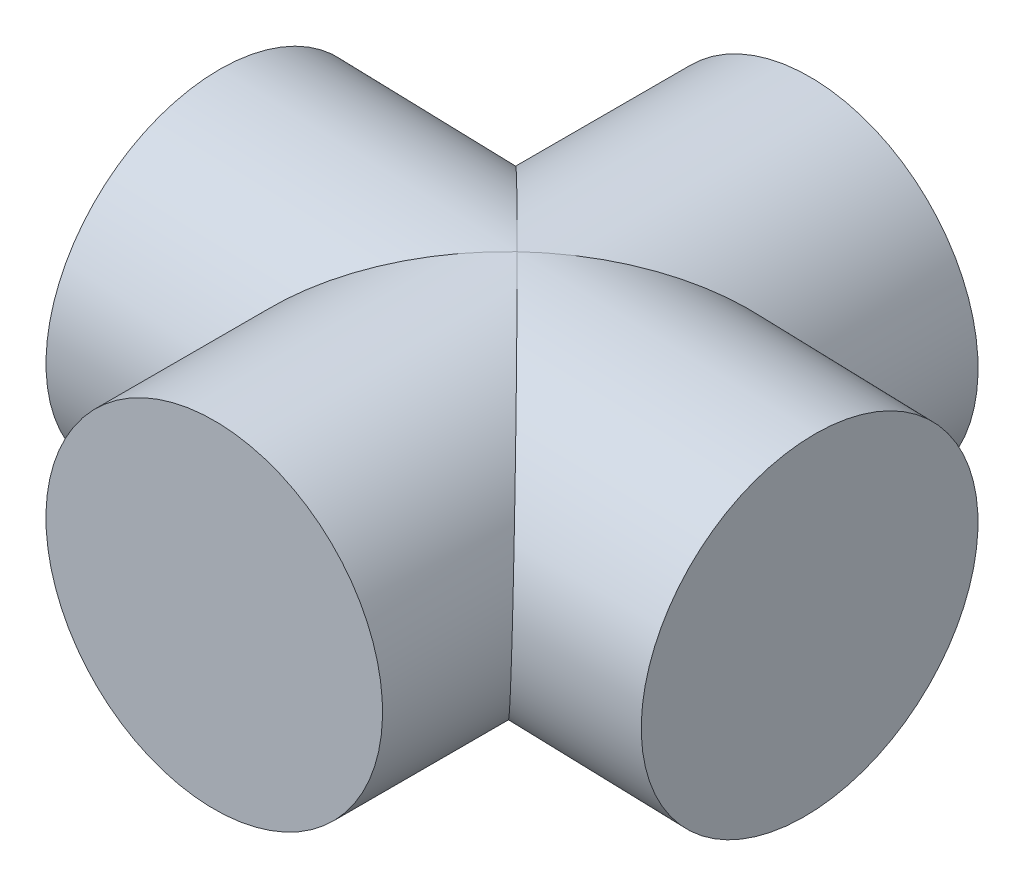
ISO-10303-21;
HEADER;
FILE_DESCRIPTION(('STEP AP214'),'2;1');
FILE_NAME('part.step','',(''),(''),'','','');
FILE_SCHEMA(('AUTOMOTIVE_DESIGN { 1 0 10303 214 1 1 1 1 }'));
ENDSEC;
DATA;
#1=APPLICATION_CONTEXT('core data for automotive mechanical design processes');
#2=APPLICATION_PROTOCOL_DEFINITION('international standard','automotive_design',2000,#1);
#3=PRODUCT_CONTEXT('',#1,'mechanical');
#4=PRODUCT('Part','Part','',(#3));
#5=PRODUCT_RELATED_PRODUCT_CATEGORY('part','',(#4));
#6=PRODUCT_DEFINITION_FORMATION('','',#4);
#7=PRODUCT_DEFINITION_CONTEXT('part definition',#1,'design');
#8=PRODUCT_DEFINITION('design','',#6,#7);
#9=PRODUCT_DEFINITION_SHAPE('','',#8);
#10=(LENGTH_UNIT() NAMED_UNIT(*) SI_UNIT(.MILLI.,.METRE.));
#11=(NAMED_UNIT(*) PLANE_ANGLE_UNIT() SI_UNIT($,.RADIAN.));
#12=(NAMED_UNIT(*) SI_UNIT($,.STERADIAN.) SOLID_ANGLE_UNIT());
#13=UNCERTAINTY_MEASURE_WITH_UNIT(LENGTH_MEASURE(1.E-05),#10,'distance_accuracy_value','');
#14=(GEOMETRIC_REPRESENTATION_CONTEXT(3) GLOBAL_UNCERTAINTY_ASSIGNED_CONTEXT((#13)) GLOBAL_UNIT_ASSIGNED_CONTEXT((#10,
#11,#12)) REPRESENTATION_CONTEXT('',''));
#15=CARTESIAN_POINT('',(0.,0.,0.));
#16=DIRECTION('',(0.,0.,1.));
#17=DIRECTION('',(1.,0.,0.));
#18=AXIS2_PLACEMENT_3D('',#15,#16,#17);
#19=CARTESIAN_POINT('',(32.9352100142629,-44.5742764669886,-65.7784848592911));
#20=DIRECTION('',(-0.999535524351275,0.0304751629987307,1.56031402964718E-07));
#21=DIRECTION('',(1.56103909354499E-07,0.,0.999999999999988));
#22=AXIS2_PLACEMENT_3D('',#19,#20,#21);
#23=CYLINDRICAL_SURFACE('',#22,6.5);
#24=DIRECTION('',(-0.999535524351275,0.0304751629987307,1.56031402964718E-07));
#25=VECTOR('',#24,1.);
#26=CARTESIAN_POINT('',(32.9352110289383,-44.5742764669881,-59.2784848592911));
#27=LINE('',#26,#25);
#28=CARTESIAN_POINT('',(32.9352110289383,-44.5742764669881,-59.2784848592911));
#29=VERTEX_POINT('',#28);
#30=CARTESIAN_POINT('',(30.4363722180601,-44.4980885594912,-59.2784844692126));
#31=VERTEX_POINT('',#30);
#32=EDGE_CURVE('E95',#29,#31,#27,.T.);
#33=ORIENTED_EDGE('',*,*,#32,.F.);
#34=ORIENTED_EDGE('',*,*,#32,.T.);
#35=CARTESIAN_POINT('',(23.7413017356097,-50.7969809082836,-65.778483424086));
#36=CARTESIAN_POINT('',(27.547145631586,-50.9130184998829,-61.9708721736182));
#37=CARTESIAN_POINT('',(30.3203346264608,-48.3039318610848,-59.2784844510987));
#38=CARTESIAN_POINT('',(30.4363722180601,-44.4980885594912,-59.2784844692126));
#39=(BOUNDED_CURVE() B_SPLINE_CURVE(3,(#35,#36,#37,#38),.UNSPECIFIED.,.F.,
.F.) B_SPLINE_CURVE_WITH_KNOTS((4,4),(1.5707963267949,3.1415926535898),
.UNSPECIFIED.) CURVE() GEOMETRIC_REPRESENTATION_ITEM() RATIONAL_B_SPLINE_CURVE((1.,
0.804737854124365,0.804737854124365,1.)) REPRESENTATION_ITEM(''));
#40=CARTESIAN_POINT('',(23.7413017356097,-50.7969809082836,-65.778483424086));
#41=VERTEX_POINT('',#40);
#42=EDGE_CURVE('E87',#41,#31,#39,.T.);
#43=ORIENTED_EDGE('',*,*,#42,.F.);
#44=CARTESIAN_POINT('',(30.4363701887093,-44.4980885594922,-72.2784844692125));
#45=CARTESIAN_POINT('',(30.32033259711,-48.3039318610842,-72.2784844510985));
#46=CARTESIAN_POINT('',(27.5471444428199,-50.9130184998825,-69.5860958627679));
#47=CARTESIAN_POINT('',(23.7413017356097,-50.7969809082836,-65.778483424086));
#48=(BOUNDED_CURVE() B_SPLINE_CURVE(3,(#44,#45,#46,#47),.UNSPECIFIED.,.F.,
.F.) B_SPLINE_CURVE_WITH_KNOTS((4,4),(3.1415926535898,4.71238898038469),
.UNSPECIFIED.) CURVE() GEOMETRIC_REPRESENTATION_ITEM() RATIONAL_B_SPLINE_CURVE((1.,
0.804737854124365,0.804737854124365,1.)) REPRESENTATION_ITEM(''));
#49=CARTESIAN_POINT('',(30.4363701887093,-44.4980885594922,-72.2784844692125));
#50=VERTEX_POINT('',#49);
#51=EDGE_CURVE('E66',#50,#41,#48,.T.);
#52=ORIENTED_EDGE('',*,*,#51,.F.);
#53=DIRECTION('',(-0.999535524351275,0.0304751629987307,1.56031402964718E-07));
#54=VECTOR('',#53,1.);
#55=CARTESIAN_POINT('',(32.9352089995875,-44.574276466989,-72.278484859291));
#56=LINE('',#55,#54);
#57=CARTESIAN_POINT('',(32.9352089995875,-44.574276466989,-72.278484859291));
#58=VERTEX_POINT('',#57);
#59=EDGE_CURVE('E101',#58,#50,#56,.T.);
#60=ORIENTED_EDGE('',*,*,#59,.F.);
#61=ORIENTED_EDGE('',*,*,#59,.T.);
#62=CARTESIAN_POINT('',(24.1374788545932,-37.8030190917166,-65.7784834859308));
#63=CARTESIAN_POINT('',(27.9433215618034,-37.9190566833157,-69.5860959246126));
#64=CARTESIAN_POINT('',(30.5524077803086,-40.6922452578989,-72.2784844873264));
#65=CARTESIAN_POINT('',(30.4363701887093,-44.4980885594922,-72.2784844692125));
#66=(BOUNDED_CURVE() B_SPLINE_CURVE(3,(#62,#63,#64,#65),.UNSPECIFIED.,.F.,
.F.) B_SPLINE_CURVE_WITH_KNOTS((4,4),(1.5707963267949,3.1415926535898),
.UNSPECIFIED.) CURVE() GEOMETRIC_REPRESENTATION_ITEM() RATIONAL_B_SPLINE_CURVE((1.,
0.804737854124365,0.804737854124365,1.)) REPRESENTATION_ITEM(''));
#67=CARTESIAN_POINT('',(24.1374788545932,-37.8030190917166,-65.7784834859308));
#68=VERTEX_POINT('',#67);
#69=EDGE_CURVE('E82',#68,#50,#66,.T.);
#70=ORIENTED_EDGE('',*,*,#69,.F.);
#71=CARTESIAN_POINT('',(30.4363722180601,-44.4980885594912,-59.2784844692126));
#72=CARTESIAN_POINT('',(30.5524098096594,-40.6922452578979,-59.2784844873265));
#73=CARTESIAN_POINT('',(27.9433227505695,-37.9190566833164,-61.970872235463));
#74=CARTESIAN_POINT('',(24.1374788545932,-37.8030190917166,-65.7784834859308));
#75=(BOUNDED_CURVE() B_SPLINE_CURVE(3,(#71,#72,#73,#74),.UNSPECIFIED.,.F.,
.F.) B_SPLINE_CURVE_WITH_KNOTS((4,4),(3.1415926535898,4.71238898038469),
.UNSPECIFIED.) CURVE() GEOMETRIC_REPRESENTATION_ITEM() RATIONAL_B_SPLINE_CURVE((1.,
0.804737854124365,0.804737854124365,1.)) REPRESENTATION_ITEM(''));
#76=EDGE_CURVE('E104',#31,#68,#75,.T.);
#77=ORIENTED_EDGE('',*,*,#76,.F.);
#78=EDGE_LOOP('',(#33,#34,#43,#52,#60,#61,#70,#77));
#79=FACE_BOUND('',#78,.T.);
#80=CARTESIAN_POINT('',(35.4340488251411,-44.6504643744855,-65.7784852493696));
#81=DIRECTION('',(-0.999535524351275,0.0304751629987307,1.56031402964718E-07));
#82=DIRECTION('',(-0.00210404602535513,-0.0690143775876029,0.997613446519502));
#83=AXIS2_PLACEMENT_3D('',#80,#81,#82);
#84=CIRCLE('',#83,6.5);
#85=CARTESIAN_POINT('',(35.4203725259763,-45.0990578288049,-59.2939978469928));
#86=VERTEX_POINT('',#85);
#87=EDGE_CURVE('E110',#86,#86,#84,.T.);
#88=ORIENTED_EDGE('',*,*,#87,.T.);
#89=EDGE_LOOP('',(#88));
#90=FACE_BOUND('',#89,.T.);
#91=ADVANCED_FACE('F16',(#79,#90),#23,.T.);
#92=CARTESIAN_POINT('',(23.9393917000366,-44.2999999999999,-56.7784834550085));
#93=DIRECTION('',(-1.56103906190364E-07,0.,-0.999999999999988));
#94=DIRECTION('',(-0.999535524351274,0.0304751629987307,1.56031399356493E-07));
#95=AXIS2_PLACEMENT_3D('',#92,#93,#94);
#96=CYLINDRICAL_SURFACE('',#95,6.5);
#97=ORIENTED_EDGE('',*,*,#69,.T.);
#98=DIRECTION('',(-1.56103906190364E-07,0.,-0.999999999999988));
#99=VECTOR('',#98,1.);
#100=CARTESIAN_POINT('',(30.4363726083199,-44.4980885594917,-56.7784844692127));
#101=LINE('',#100,#99);
#102=CARTESIAN_POINT('',(30.4363697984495,-44.4980885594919,-74.7784844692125));
#103=VERTEX_POINT('',#102);
#104=EDGE_CURVE('E20',#50,#103,#101,.T.);
#105=ORIENTED_EDGE('',*,*,#104,.T.);
#106=ORIENTED_EDGE('',*,*,#104,.F.);
#107=ORIENTED_EDGE('',*,*,#51,.T.);
#108=CARTESIAN_POINT('',(23.7413017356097,-50.7969809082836,-65.778483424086));
#109=CARTESIAN_POINT('',(19.9354578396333,-50.6809433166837,-69.5860946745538));
#110=CARTESIAN_POINT('',(17.3263707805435,-47.9077547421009,-72.2784824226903));
#111=CARTESIAN_POINT('',(17.4424083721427,-44.1019114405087,-72.2784824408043));
#112=(BOUNDED_CURVE() B_SPLINE_CURVE(3,(#108,#109,#110,#111),.UNSPECIFIED.,.F.,
.F.) B_SPLINE_CURVE_WITH_KNOTS((4,4),(4.71238898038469,6.28318530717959),
.UNSPECIFIED.) CURVE() GEOMETRIC_REPRESENTATION_ITEM() RATIONAL_B_SPLINE_CURVE((1.,
0.804737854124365,0.804737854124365,1.)) REPRESENTATION_ITEM(''));
#113=CARTESIAN_POINT('',(17.4424083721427,-44.1019114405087,-72.2784824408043));
#114=VERTEX_POINT('',#113);
#115=EDGE_CURVE('E27',#41,#114,#112,.T.);
#116=ORIENTED_EDGE('',*,*,#115,.T.);
#117=DIRECTION('',(-1.56103906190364E-07,0.,-0.999999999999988));
#118=VECTOR('',#117,1.);
#119=CARTESIAN_POINT('',(17.4424107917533,-44.1019114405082,-56.7784824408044));
#120=LINE('',#119,#118);
#121=CARTESIAN_POINT('',(17.442407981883,-44.1019114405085,-74.7784824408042));
#122=VERTEX_POINT('',#121);
#123=EDGE_CURVE('E147',#114,#122,#120,.T.);
#124=ORIENTED_EDGE('',*,*,#123,.T.);
#125=ORIENTED_EDGE('',*,*,#123,.F.);
#126=CARTESIAN_POINT('',(17.4424083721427,-44.1019114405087,-72.2784824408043));
#127=CARTESIAN_POINT('',(17.5584459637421,-40.2960681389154,-72.2784824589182));
#128=CARTESIAN_POINT('',(20.3316349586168,-37.686981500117,-69.5860947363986));
#129=CARTESIAN_POINT('',(24.1374788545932,-37.8030190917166,-65.7784834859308));
#130=(BOUNDED_CURVE() B_SPLINE_CURVE(3,(#126,#127,#128,#129),.UNSPECIFIED.,.F.,
.F.) B_SPLINE_CURVE_WITH_KNOTS((4,4),(0.,1.5707963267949),
.UNSPECIFIED.) CURVE() GEOMETRIC_REPRESENTATION_ITEM() RATIONAL_B_SPLINE_CURVE((1.,
0.804737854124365,0.804737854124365,1.)) REPRESENTATION_ITEM(''));
#131=EDGE_CURVE('E145',#114,#68,#130,.T.);
#132=ORIENTED_EDGE('',*,*,#131,.T.);
#133=EDGE_LOOP('',(#97,#105,#106,#107,#116,#124,#125,#132));
#134=FACE_BOUND('',#133,.T.);
#135=CARTESIAN_POINT('',(23.9393884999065,-44.2999999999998,-77.2784834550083));
#136=DIRECTION('',(1.56103906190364E-07,0.,0.999999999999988));
#137=DIRECTION('',(0.999535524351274,-0.0304751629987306,-1.56031399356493E-07));
#138=AXIS2_PLACEMENT_3D('',#135,#136,#137);
#139=CIRCLE('',#138,6.5);
#140=CARTESIAN_POINT('',(30.4363694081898,-44.4980885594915,-77.2784844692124));
#141=VERTEX_POINT('',#140);
#142=EDGE_CURVE('E188',#141,#141,#139,.T.);
#143=ORIENTED_EDGE('',*,*,#142,.T.);
#144=EDGE_LOOP('',(#143));
#145=FACE_BOUND('',#144,.T.);
#146=ADVANCED_FACE('F18',(#134,#145),#96,.T.);
#147=CARTESIAN_POINT('',(32.9352100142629,-44.5742764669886,-65.7784848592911));
#148=DIRECTION('',(-0.999535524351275,0.0304751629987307,1.56031402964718E-07));
#149=DIRECTION('',(1.56103909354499E-07,0.,0.999999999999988));
#150=AXIS2_PLACEMENT_3D('',#147,#148,#149);
#151=CYLINDRICAL_SURFACE('',#150,6.5);
#152=ORIENTED_EDGE('',*,*,#131,.F.);
#153=DIRECTION('',(-0.999535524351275,0.0304751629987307,1.56031402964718E-07));
#154=VECTOR('',#153,1.);
#155=CARTESIAN_POINT('',(32.9352089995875,-44.574276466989,-72.278484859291));
#156=LINE('',#155,#154);
#157=CARTESIAN_POINT('',(14.9435695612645,-44.0257235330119,-72.2784820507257));
#158=VERTEX_POINT('',#157);
#159=EDGE_CURVE('E173',#114,#158,#156,.T.);
#160=ORIENTED_EDGE('',*,*,#159,.T.);
#161=ORIENTED_EDGE('',*,*,#159,.F.);
#162=ORIENTED_EDGE('',*,*,#115,.F.);
#163=CARTESIAN_POINT('',(17.4424104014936,-44.1019114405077,-59.2784824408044));
#164=CARTESIAN_POINT('',(17.3263728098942,-47.9077547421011,-59.2784824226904));
#165=CARTESIAN_POINT('',(19.9354590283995,-50.6809433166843,-61.9708709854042));
#166=CARTESIAN_POINT('',(23.7413017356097,-50.7969809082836,-65.778483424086));
#167=(BOUNDED_CURVE() B_SPLINE_CURVE(3,(#163,#164,#165,#166),.UNSPECIFIED.,.F.,
.F.) B_SPLINE_CURVE_WITH_KNOTS((4,4),(0.,1.5707963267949),
.UNSPECIFIED.) CURVE() GEOMETRIC_REPRESENTATION_ITEM() RATIONAL_B_SPLINE_CURVE((1.,
0.804737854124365,0.804737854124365,1.)) REPRESENTATION_ITEM(''));
#168=CARTESIAN_POINT('',(17.4424104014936,-44.1019114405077,-59.2784824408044));
#169=VERTEX_POINT('',#168);
#170=EDGE_CURVE('E10',#169,#41,#167,.T.);
#171=ORIENTED_EDGE('',*,*,#170,.F.);
#172=DIRECTION('',(-0.999535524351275,0.0304751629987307,1.56031402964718E-07));
#173=VECTOR('',#172,1.);
#174=CARTESIAN_POINT('',(32.9352110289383,-44.5742764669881,-59.2784848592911));
#175=LINE('',#174,#173);
#176=CARTESIAN_POINT('',(14.9435715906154,-44.0257235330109,-59.2784820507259));
#177=VERTEX_POINT('',#176);
#178=EDGE_CURVE('E56',#169,#177,#175,.T.);
#179=ORIENTED_EDGE('',*,*,#178,.T.);
#180=ORIENTED_EDGE('',*,*,#178,.F.);
#181=CARTESIAN_POINT('',(24.1374788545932,-37.8030190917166,-65.7784834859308));
#182=CARTESIAN_POINT('',(20.3316361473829,-37.6869815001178,-61.970871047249));
#183=CARTESIAN_POINT('',(17.5584479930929,-40.2960681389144,-59.2784824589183));
#184=CARTESIAN_POINT('',(17.4424104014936,-44.1019114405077,-59.2784824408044));
#185=(BOUNDED_CURVE() B_SPLINE_CURVE(3,(#181,#182,#183,#184),.UNSPECIFIED.,.F.,
.F.) B_SPLINE_CURVE_WITH_KNOTS((4,4),(4.71238898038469,6.28318530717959),
.UNSPECIFIED.) CURVE() GEOMETRIC_REPRESENTATION_ITEM() RATIONAL_B_SPLINE_CURVE((1.,
0.804737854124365,0.804737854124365,1.)) REPRESENTATION_ITEM(''));
#186=EDGE_CURVE('E107',#68,#169,#185,.T.);
#187=ORIENTED_EDGE('',*,*,#186,.F.);
#188=EDGE_LOOP('',(#152,#160,#161,#162,#171,#179,#180,#187));
#189=FACE_BOUND('',#188,.T.);
#190=CARTESIAN_POINT('',(12.4447317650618,-43.9495356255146,-65.7784816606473));
#191=DIRECTION('',(-0.999535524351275,0.0304751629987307,1.56031402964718E-07));
#192=DIRECTION('',(-0.00210404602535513,-0.0690143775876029,0.997613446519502));
#193=AXIS2_PLACEMENT_3D('',#190,#191,#192);
#194=CIRCLE('',#193,6.5);
#195=CARTESIAN_POINT('',(12.431055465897,-44.398129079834,-59.2939942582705));
#196=VERTEX_POINT('',#195);
#197=EDGE_CURVE('E115',#196,#196,#194,.T.);
#198=ORIENTED_EDGE('',*,*,#197,.F.);
#199=EDGE_LOOP('',(#198));
#200=FACE_BOUND('',#199,.T.);
#201=ADVANCED_FACE('F198',(#189,#200),#151,.T.);
#202=CARTESIAN_POINT('',(23.9393917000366,-44.2999999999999,-56.7784834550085));
#203=DIRECTION('',(-1.56103906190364E-07,0.,-0.999999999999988));
#204=DIRECTION('',(-0.999535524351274,0.0304751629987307,1.56031399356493E-07));
#205=AXIS2_PLACEMENT_3D('',#202,#203,#204);
#206=CYLINDRICAL_SURFACE('',#205,6.5);
#207=DIRECTION('',(-1.56103906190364E-07,0.,-0.999999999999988));
#208=VECTOR('',#207,1.);
#209=CARTESIAN_POINT('',(17.4424107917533,-44.1019114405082,-56.7784824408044));
#210=LINE('',#209,#208);
#211=CARTESIAN_POINT('',(17.4424107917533,-44.1019114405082,-56.7784824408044));
#212=VERTEX_POINT('',#211);
#213=EDGE_CURVE('E141',#212,#169,#210,.T.);
#214=ORIENTED_EDGE('',*,*,#213,.F.);
#215=ORIENTED_EDGE('',*,*,#213,.T.);
#216=ORIENTED_EDGE('',*,*,#170,.T.);
#217=ORIENTED_EDGE('',*,*,#42,.T.);
#218=DIRECTION('',(-1.56103906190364E-07,0.,-0.999999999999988));
#219=VECTOR('',#218,1.);
#220=CARTESIAN_POINT('',(30.4363726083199,-44.4980885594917,-56.7784844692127));
#221=LINE('',#220,#219);
#222=CARTESIAN_POINT('',(30.4363726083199,-44.4980885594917,-56.7784844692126));
#223=VERTEX_POINT('',#222);
#224=EDGE_CURVE('E93',#223,#31,#221,.T.);
#225=ORIENTED_EDGE('',*,*,#224,.F.);
#226=ORIENTED_EDGE('',*,*,#224,.T.);
#227=ORIENTED_EDGE('',*,*,#76,.T.);
#228=ORIENTED_EDGE('',*,*,#186,.T.);
#229=EDGE_LOOP('',(#214,#215,#216,#217,#225,#226,#227,#228));
#230=FACE_BOUND('',#229,.T.);
#231=CARTESIAN_POINT('',(23.9393920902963,-44.3000000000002,-54.2784834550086));
#232=DIRECTION('',(1.56103906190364E-07,0.,0.999999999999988));
#233=DIRECTION('',(0.999535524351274,-0.0304751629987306,-1.56031399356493E-07));
#234=AXIS2_PLACEMENT_3D('',#231,#232,#233);
#235=CIRCLE('',#234,6.5);
#236=CARTESIAN_POINT('',(30.4363729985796,-44.498088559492,-54.2784844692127));
#237=VERTEX_POINT('',#236);
#238=EDGE_CURVE('E191',#237,#237,#235,.T.);
#239=ORIENTED_EDGE('',*,*,#238,.F.);
#240=EDGE_LOOP('',(#239));
#241=FACE_BOUND('',#240,.T.);
#242=ADVANCED_FACE('F89',(#230,#241),#206,.T.);
#243=CARTESIAN_POINT('',(35.4340488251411,-44.6504643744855,-65.7784852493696));
#244=DIRECTION('',(-0.999535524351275,0.0304751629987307,1.56031402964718E-07));
#245=DIRECTION('',(-0.00210404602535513,-0.0690143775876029,0.997613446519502));
#246=AXIS2_PLACEMENT_3D('',#243,#244,#245);
#247=PLANE('',#246);
#248=ORIENTED_EDGE('',*,*,#87,.F.);
#249=EDGE_LOOP('',(#248));
#250=FACE_BOUND('',#249,.T.);
#251=ADVANCED_FACE('F197',(#250),#247,.F.);
#252=CARTESIAN_POINT('',(12.4447317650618,-43.9495356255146,-65.7784816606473));
#253=DIRECTION('',(-0.999535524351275,0.0304751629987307,1.56031402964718E-07));
#254=DIRECTION('',(-0.00210404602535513,-0.0690143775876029,0.997613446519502));
#255=AXIS2_PLACEMENT_3D('',#252,#253,#254);
#256=PLANE('',#255);
#257=ORIENTED_EDGE('',*,*,#197,.T.);
#258=EDGE_LOOP('',(#257));
#259=FACE_BOUND('',#258,.T.);
#260=ADVANCED_FACE('F204',(#259),#256,.T.);
#261=CARTESIAN_POINT('',(23.9393884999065,-44.2999999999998,-77.2784834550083));
#262=DIRECTION('',(1.56103906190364E-07,0.,0.999999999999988));
#263=DIRECTION('',(0.999535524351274,-0.0304751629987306,-1.56031399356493E-07));
#264=AXIS2_PLACEMENT_3D('',#261,#262,#263);
#265=PLANE('',#264);
#266=ORIENTED_EDGE('',*,*,#142,.F.);
#267=EDGE_LOOP('',(#266));
#268=FACE_BOUND('',#267,.T.);
#269=ADVANCED_FACE('F216',(#268),#265,.F.);
#270=CARTESIAN_POINT('',(23.9393920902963,-44.3000000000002,-54.2784834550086));
#271=DIRECTION('',(1.56103906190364E-07,0.,0.999999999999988));
#272=DIRECTION('',(0.999535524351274,-0.0304751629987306,-1.56031399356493E-07));
#273=AXIS2_PLACEMENT_3D('',#270,#271,#272);
#274=PLANE('',#273);
#275=ORIENTED_EDGE('',*,*,#238,.T.);
#276=EDGE_LOOP('',(#275));
#277=FACE_BOUND('',#276,.T.);
#278=ADVANCED_FACE('F195',(#277),#274,.T.);
#279=CLOSED_SHELL('',(#91,#146,#201,#242,#251,#260,#269,#278));
#280=MANIFOLD_SOLID_BREP('B1',#279);
#281=ADVANCED_BREP_SHAPE_REPRESENTATION('',(#18,#280),#14);
#282=SHAPE_DEFINITION_REPRESENTATION(#9,#281);
ENDSEC;
END-ISO-10303-21;
